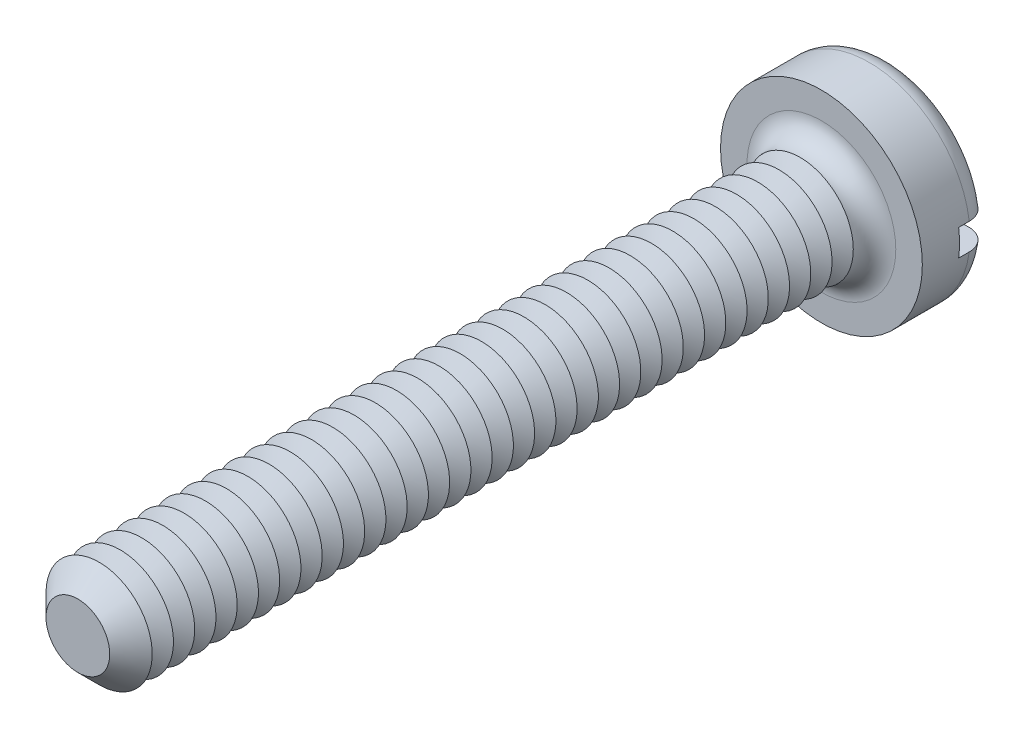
from build123d import *

# Parameters (mm, degrees)
SKETCH3_R           = 1.9
BOSS_EXTRUDE2_DEPTH = 1.3
SKETCH4_R           = 1
BOSS_EXTRUDE3_DEPTH = 14
FILLET1_R           = 0.4
CHAMFER1_SIZE       = 0.4
LPATTERN1_COUNT     = 33
LPATTERN1_PITCH     = 0.4
SKETCH8_W           = 3.8
SKETCH8_H           = 0.5
CUT_EXTRUDE1_DEPTH  = 0.6


with BuildPart() as part:
    # Sketch3 → Boss-Extrude2 (new body)
    with BuildSketch(Plane.XY):
        Circle(SKETCH3_R)
    extrude(amount=-BOSS_EXTRUDE2_DEPTH)

    # Sketch4 → Boss-Extrude3 (add)
    with BuildSketch(Plane.XY):
        Circle(SKETCH4_R)
    extrude(amount=BOSS_EXTRUDE3_DEPTH)

    # Fillet1
    fillet1_edges = [part.edges().sort_by_distance(p)[0] for p in [
        (-1.9, 0, -1.3),
        (-1, 0, 0),
    ]]
    fillet(fillet1_edges, radius=FILLET1_R)

    # Chamfer1
    chamfer1_edges = [part.edges().sort_by_distance(p)[0] for p in [
        (-1, 0, 14),
    ]]
    chamfer(chamfer1_edges, length=CHAMFER1_SIZE)

    # Sketch6 → Cut-Revolve1 (revolve, cut)
    with BuildSketch(Plane(origin=(0, 0, 0), x_dir=(0, 0, -1), z_dir=(1, 0, 0)), mode=Mode.PRIVATE) as cut_revolve1_sk:
        Polygon((-0.4, 1), (-0.6, 0.653589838), (-0.8, 1), align=None)
    cut_revolve1 = revolve(cut_revolve1_sk.sketch.rotate(Axis((0, 0, -1.694361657), (0, 0, 1)), 90), axis=Axis((0, 0, -1.694361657), (0, 0, 1)), mode=Mode.SUBTRACT)

    # LPattern1: Cut-Revolve1 ×33
    with Locations(*[(0, 0, i * LPATTERN1_PITCH) for i in range(1, LPATTERN1_COUNT)]):
        add(cut_revolve1, mode=Mode.SUBTRACT)

    # Sketch8 → Cut-Extrude1 (cut)
    with BuildSketch(Plane(origin=(0, 0, -1.3), x_dir=(-1, 0, 0), z_dir=(0, 0, -1))):
        Rectangle(SKETCH8_W, SKETCH8_H)
    extrude(amount=-CUT_EXTRUDE1_DEPTH, mode=Mode.SUBTRACT)


solid = part.part
